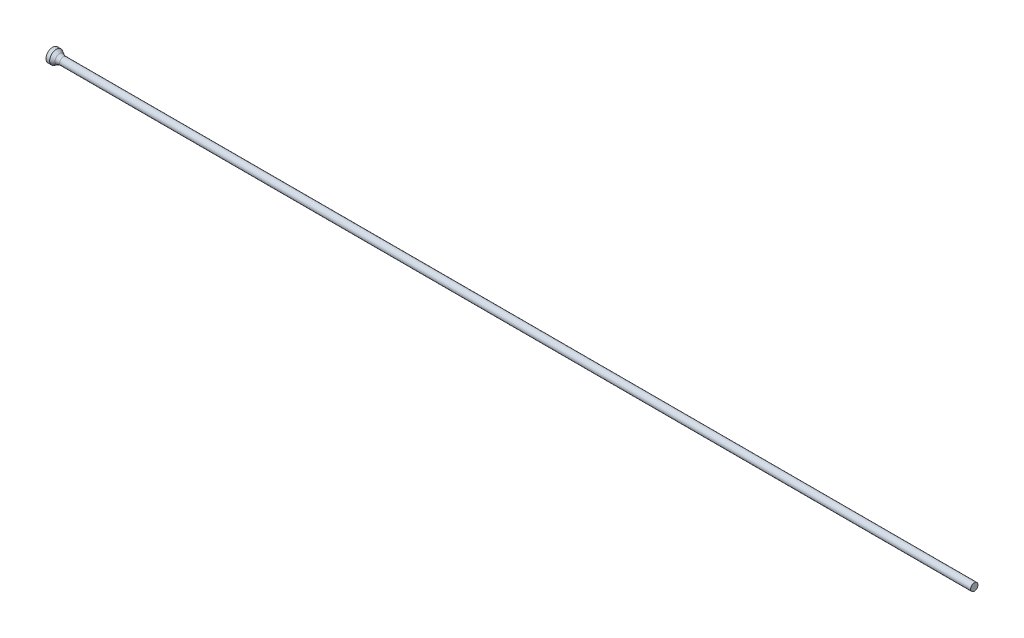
ISO-10303-21;
HEADER;
FILE_DESCRIPTION(('STEP AP214'),'2;1');
FILE_NAME('part.step','',(''),(''),'','','');
FILE_SCHEMA(('AUTOMOTIVE_DESIGN { 1 0 10303 214 1 1 1 1 }'));
ENDSEC;
DATA;
#1=APPLICATION_CONTEXT('core data for automotive mechanical design processes');
#2=APPLICATION_PROTOCOL_DEFINITION('international standard','automotive_design',2000,#1);
#3=PRODUCT_CONTEXT('',#1,'mechanical');
#4=PRODUCT('Part','Part','',(#3));
#5=PRODUCT_RELATED_PRODUCT_CATEGORY('part','',(#4));
#6=PRODUCT_DEFINITION_FORMATION('','',#4);
#7=PRODUCT_DEFINITION_CONTEXT('part definition',#1,'design');
#8=PRODUCT_DEFINITION('design','',#6,#7);
#9=PRODUCT_DEFINITION_SHAPE('','',#8);
#10=(LENGTH_UNIT() NAMED_UNIT(*) SI_UNIT(.MILLI.,.METRE.));
#11=(NAMED_UNIT(*) PLANE_ANGLE_UNIT() SI_UNIT($,.RADIAN.));
#12=(NAMED_UNIT(*) SI_UNIT($,.STERADIAN.) SOLID_ANGLE_UNIT());
#13=UNCERTAINTY_MEASURE_WITH_UNIT(LENGTH_MEASURE(1.E-05),#10,'distance_accuracy_value','');
#14=(GEOMETRIC_REPRESENTATION_CONTEXT(3) GLOBAL_UNCERTAINTY_ASSIGNED_CONTEXT((#13)) GLOBAL_UNIT_ASSIGNED_CONTEXT((#10,
#11,#12)) REPRESENTATION_CONTEXT('',''));
#15=CARTESIAN_POINT('',(0.,0.,0.));
#16=DIRECTION('',(0.,0.,1.));
#17=DIRECTION('',(1.,0.,0.));
#18=AXIS2_PLACEMENT_3D('',#15,#16,#17);
#19=CARTESIAN_POINT('',(0.,0.,0.));
#20=DIRECTION('',(1.,0.,0.));
#21=DIRECTION('',(0.,0.,-1.));
#22=AXIS2_PLACEMENT_3D('',#19,#20,#21);
#23=PLANE('',#22);
#24=CARTESIAN_POINT('',(0.,0.,0.));
#25=DIRECTION('',(-1.,0.,0.));
#26=DIRECTION('',(0.,0.,1.));
#27=AXIS2_PLACEMENT_3D('',#24,#25,#26);
#28=CIRCLE('',#27,0.9);
#29=CARTESIAN_POINT('',(0.,0.,0.9));
#30=VERTEX_POINT('',#29);
#31=EDGE_CURVE('E25',#30,#30,#28,.T.);
#32=ORIENTED_EDGE('',*,*,#31,.T.);
#33=EDGE_LOOP('',(#32));
#34=FACE_BOUND('',#33,.T.);
#35=ADVANCED_FACE('F14',(#34),#23,.F.);
#36=CARTESIAN_POINT('',(0.,0.,0.));
#37=DIRECTION('',(-1.,0.,0.));
#38=DIRECTION('',(0.,0.,1.));
#39=AXIS2_PLACEMENT_3D('',#36,#37,#38);
#40=CYLINDRICAL_SURFACE('',#39,0.9);
#41=ORIENTED_EDGE('',*,*,#31,.F.);
#42=EDGE_LOOP('',(#41));
#43=FACE_BOUND('',#42,.T.);
#44=CARTESIAN_POINT('',(0.497179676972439,0.,0.));
#45=DIRECTION('',(-1.,0.,0.));
#46=DIRECTION('',(0.,0.,1.));
#47=AXIS2_PLACEMENT_3D('',#44,#45,#46);
#48=CIRCLE('',#47,0.9);
#49=CARTESIAN_POINT('',(0.497179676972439,0.,0.9));
#50=VERTEX_POINT('',#49);
#51=EDGE_CURVE('E29',#50,#50,#48,.T.);
#52=ORIENTED_EDGE('',*,*,#51,.T.);
#53=EDGE_LOOP('',(#52));
#54=FACE_BOUND('',#53,.T.);
#55=ADVANCED_FACE('F53',(#43,#54),#40,.T.);
#56=CARTESIAN_POINT('',(1.19,0.,0.));
#57=DIRECTION('',(-1.,0.,0.));
#58=DIRECTION('',(0.,0.,1.));
#59=AXIS2_PLACEMENT_3D('',#56,#57,#58);
#60=CONICAL_SURFACE('',#59,0.5,0.523598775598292);
#61=CARTESIAN_POINT('',(0.957949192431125,0.,0.));
#62=DIRECTION('',(-1.,0.,0.));
#63=DIRECTION('',(0.,0.,1.));
#64=AXIS2_PLACEMENT_3D('',#61,#62,#63);
#65=CIRCLE('',#64,0.633974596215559);
#66=CARTESIAN_POINT('',(0.957949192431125,0.,0.633974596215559));
#67=VERTEX_POINT('',#66);
#68=EDGE_CURVE('E21',#67,#67,#65,.T.);
#69=ORIENTED_EDGE('',*,*,#68,.T.);
#70=EDGE_LOOP('',(#69));
#71=FACE_BOUND('',#70,.T.);
#72=ORIENTED_EDGE('',*,*,#51,.F.);
#73=EDGE_LOOP('',(#72));
#74=FACE_BOUND('',#73,.T.);
#75=ADVANCED_FACE('F50',(#71,#74),#60,.T.);
#76=CARTESIAN_POINT('',(0.,0.,0.));
#77=DIRECTION('',(-1.,0.,0.));
#78=DIRECTION('',(0.,0.,1.));
#79=AXIS2_PLACEMENT_3D('',#76,#77,#78);
#80=CYLINDRICAL_SURFACE('',#79,0.5);
#81=CARTESIAN_POINT('',(1.45794919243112,0.,0.));
#82=DIRECTION('',(-1.,0.,0.));
#83=DIRECTION('',(0.,0.,1.));
#84=AXIS2_PLACEMENT_3D('',#81,#82,#83);
#85=CIRCLE('',#84,0.5);
#86=CARTESIAN_POINT('',(1.45794919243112,0.,0.5));
#87=VERTEX_POINT('',#86);
#88=EDGE_CURVE('E9',#87,#87,#85,.F.);
#89=ORIENTED_EDGE('',*,*,#88,.T.);
#90=EDGE_LOOP('',(#89));
#91=FACE_BOUND('',#90,.T.);
#92=CARTESIAN_POINT('',(125.,0.,0.));
#93=DIRECTION('',(-1.,0.,0.));
#94=DIRECTION('',(0.,0.,1.));
#95=AXIS2_PLACEMENT_3D('',#92,#93,#94);
#96=CIRCLE('',#95,0.5);
#97=CARTESIAN_POINT('',(125.,0.,0.5));
#98=VERTEX_POINT('',#97);
#99=EDGE_CURVE('E34',#98,#98,#96,.T.);
#100=ORIENTED_EDGE('',*,*,#99,.T.);
#101=EDGE_LOOP('',(#100));
#102=FACE_BOUND('',#101,.T.);
#103=ADVANCED_FACE('F38',(#91,#102),#80,.T.);
#104=CARTESIAN_POINT('',(125.,0.5,0.));
#105=DIRECTION('',(-1.,0.,0.));
#106=DIRECTION('',(0.,0.,1.));
#107=AXIS2_PLACEMENT_3D('',#104,#105,#106);
#108=PLANE('',#107);
#109=ORIENTED_EDGE('',*,*,#99,.F.);
#110=EDGE_LOOP('',(#109));
#111=FACE_BOUND('',#110,.T.);
#112=ADVANCED_FACE('F40',(#111),#108,.F.);
#113=CARTESIAN_POINT('',(1.45794919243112,0.,0.));
#114=DIRECTION('',(-1.,0.,0.));
#115=DIRECTION('',(0.,0.,1.));
#116=AXIS2_PLACEMENT_3D('',#113,#114,#115);
#117=TOROIDAL_SURFACE('',#116,1.5,1.);
#118=ORIENTED_EDGE('',*,*,#88,.F.);
#119=EDGE_LOOP('',(#118));
#120=FACE_BOUND('',#119,.T.);
#121=ORIENTED_EDGE('',*,*,#68,.F.);
#122=EDGE_LOOP('',(#121));
#123=FACE_BOUND('',#122,.T.);
#124=ADVANCED_FACE('F16',(#120,#123),#117,.F.);
#125=CLOSED_SHELL('',(#35,#55,#75,#103,#112,#124));
#126=MANIFOLD_SOLID_BREP('B1',#125);
#127=ADVANCED_BREP_SHAPE_REPRESENTATION('',(#18,#126),#14);
#128=SHAPE_DEFINITION_REPRESENTATION(#9,#127);
ENDSEC;
END-ISO-10303-21;
